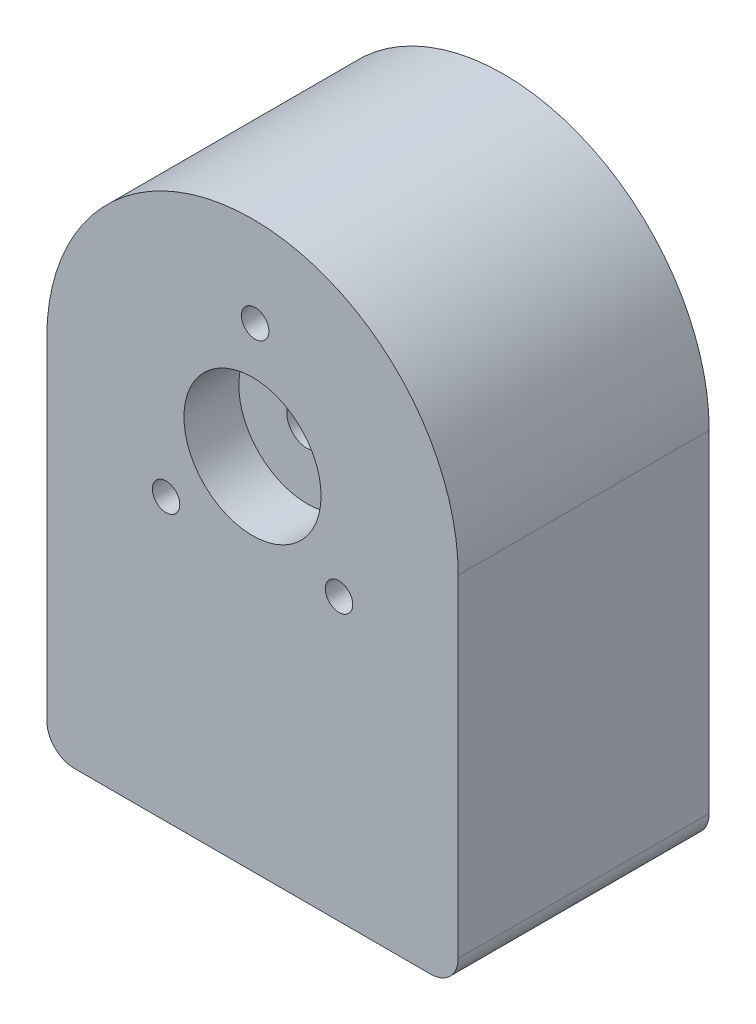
ISO-10303-21;
HEADER;
FILE_DESCRIPTION(('STEP AP214'),'2;1');
FILE_NAME('part.step','',(''),(''),'','','');
FILE_SCHEMA(('AUTOMOTIVE_DESIGN { 1 0 10303 214 1 1 1 1 }'));
ENDSEC;
DATA;
#1=APPLICATION_CONTEXT('core data for automotive mechanical design processes');
#2=APPLICATION_PROTOCOL_DEFINITION('international standard','automotive_design',2000,#1);
#3=PRODUCT_CONTEXT('',#1,'mechanical');
#4=PRODUCT('Part','Part','',(#3));
#5=PRODUCT_RELATED_PRODUCT_CATEGORY('part','',(#4));
#6=PRODUCT_DEFINITION_FORMATION('','',#4);
#7=PRODUCT_DEFINITION_CONTEXT('part definition',#1,'design');
#8=PRODUCT_DEFINITION('design','',#6,#7);
#9=PRODUCT_DEFINITION_SHAPE('','',#8);
#10=(LENGTH_UNIT() NAMED_UNIT(*) SI_UNIT(.MILLI.,.METRE.));
#11=(NAMED_UNIT(*) PLANE_ANGLE_UNIT() SI_UNIT($,.RADIAN.));
#12=(NAMED_UNIT(*) SI_UNIT($,.STERADIAN.) SOLID_ANGLE_UNIT());
#13=UNCERTAINTY_MEASURE_WITH_UNIT(LENGTH_MEASURE(1.E-05),#10,'distance_accuracy_value','');
#14=(GEOMETRIC_REPRESENTATION_CONTEXT(3) GLOBAL_UNCERTAINTY_ASSIGNED_CONTEXT((#13)) GLOBAL_UNIT_ASSIGNED_CONTEXT((#10,
#11,#12)) REPRESENTATION_CONTEXT('',''));
#15=CARTESIAN_POINT('',(0.,0.,0.));
#16=DIRECTION('',(0.,0.,1.));
#17=DIRECTION('',(1.,0.,0.));
#18=AXIS2_PLACEMENT_3D('',#15,#16,#17);
#19=CARTESIAN_POINT('',(-11.4705882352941,11.5529411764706,18.3));
#20=DIRECTION('',(0.,0.,-1.));
#21=DIRECTION('',(-1.,0.,0.));
#22=AXIS2_PLACEMENT_3D('',#19,#20,#21);
#23=CYLINDRICAL_SURFACE('',#22,15.);
#24=CARTESIAN_POINT('',(-11.4705882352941,11.5529411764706,0.));
#25=DIRECTION('',(0.,0.,1.));
#26=DIRECTION('',(1.,0.,0.));
#27=AXIS2_PLACEMENT_3D('',#24,#25,#26);
#28=CIRCLE('',#27,15.);
#29=CARTESIAN_POINT('',(3.52941176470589,11.5529411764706,0.));
#30=VERTEX_POINT('',#29);
#31=CARTESIAN_POINT('',(-26.4705882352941,11.5529411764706,0.));
#32=VERTEX_POINT('',#31);
#33=EDGE_CURVE('E106',#30,#32,#28,.T.);
#34=ORIENTED_EDGE('',*,*,#33,.T.);
#35=DIRECTION('',(0.,0.,-1.));
#36=VECTOR('',#35,1.);
#37=CARTESIAN_POINT('',(-26.4705882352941,11.5529411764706,18.3));
#38=LINE('',#37,#36);
#39=CARTESIAN_POINT('',(-26.4705882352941,11.5529411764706,18.3));
#40=VERTEX_POINT('',#39);
#41=EDGE_CURVE('E89',#40,#32,#38,.T.);
#42=ORIENTED_EDGE('',*,*,#41,.F.);
#43=CARTESIAN_POINT('',(-11.4705882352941,11.5529411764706,18.3));
#44=DIRECTION('',(0.,0.,1.));
#45=DIRECTION('',(1.,0.,0.));
#46=AXIS2_PLACEMENT_3D('',#43,#44,#45);
#47=CIRCLE('',#46,15.);
#48=CARTESIAN_POINT('',(3.52941176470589,11.5529411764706,18.3));
#49=VERTEX_POINT('',#48);
#50=EDGE_CURVE('E94',#49,#40,#47,.T.);
#51=ORIENTED_EDGE('',*,*,#50,.F.);
#52=DIRECTION('',(0.,0.,-1.));
#53=VECTOR('',#52,1.);
#54=CARTESIAN_POINT('',(3.52941176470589,11.5529411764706,18.3));
#55=LINE('',#54,#53);
#56=EDGE_CURVE('E108',#49,#30,#55,.T.);
#57=ORIENTED_EDGE('',*,*,#56,.T.);
#58=EDGE_LOOP('',(#34,#42,#51,#57));
#59=FACE_BOUND('',#58,.T.);
#60=ADVANCED_FACE('F33',(#59),#23,.T.);
#61=CARTESIAN_POINT('',(-26.4705882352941,11.5529411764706,18.3));
#62=DIRECTION('',(1.,0.,0.));
#63=DIRECTION('',(0.,1.,0.));
#64=AXIS2_PLACEMENT_3D('',#61,#62,#63);
#65=PLANE('',#64);
#66=DIRECTION('',(0.,-1.,0.));
#67=VECTOR('',#66,1.);
#68=CARTESIAN_POINT('',(-26.4705882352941,11.5529411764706,0.));
#69=LINE('',#68,#67);
#70=CARTESIAN_POINT('',(-26.4705882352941,-12.6470588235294,0.));
#71=VERTEX_POINT('',#70);
#72=EDGE_CURVE('E138',#32,#71,#69,.T.);
#73=ORIENTED_EDGE('',*,*,#72,.T.);
#74=DIRECTION('',(0.,0.,-1.));
#75=VECTOR('',#74,1.);
#76=CARTESIAN_POINT('',(-26.4705882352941,-12.6470588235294,18.3));
#77=LINE('',#76,#75);
#78=CARTESIAN_POINT('',(-26.4705882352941,-12.6470588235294,18.3));
#79=VERTEX_POINT('',#78);
#80=EDGE_CURVE('E11',#71,#79,#77,.F.);
#81=ORIENTED_EDGE('',*,*,#80,.T.);
#82=DIRECTION('',(0.,-1.,0.));
#83=VECTOR('',#82,1.);
#84=CARTESIAN_POINT('',(-26.4705882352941,11.5529411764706,18.3));
#85=LINE('',#84,#83);
#86=EDGE_CURVE('E85',#40,#79,#85,.T.);
#87=ORIENTED_EDGE('',*,*,#86,.F.);
#88=ORIENTED_EDGE('',*,*,#41,.T.);
#89=EDGE_LOOP('',(#73,#81,#87,#88));
#90=FACE_BOUND('',#89,.T.);
#91=ADVANCED_FACE('F87',(#90),#65,.F.);
#92=CARTESIAN_POINT('',(-26.4705882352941,-14.6470588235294,18.3));
#93=DIRECTION('',(0.,1.,0.));
#94=DIRECTION('',(0.,0.,1.));
#95=AXIS2_PLACEMENT_3D('',#92,#93,#94);
#96=PLANE('',#95);
#97=DIRECTION('',(1.,0.,0.));
#98=VECTOR('',#97,1.);
#99=CARTESIAN_POINT('',(-26.4705882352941,-14.6470588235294,0.));
#100=LINE('',#99,#98);
#101=CARTESIAN_POINT('',(-24.4705882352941,-14.6470588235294,0.));
#102=VERTEX_POINT('',#101);
#103=CARTESIAN_POINT('',(1.52941176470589,-14.6470588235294,0.));
#104=VERTEX_POINT('',#103);
#105=EDGE_CURVE('E135',#102,#104,#100,.T.);
#106=ORIENTED_EDGE('',*,*,#105,.T.);
#107=DIRECTION('',(0.,0.,-1.));
#108=VECTOR('',#107,1.);
#109=CARTESIAN_POINT('',(1.52941176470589,-14.6470588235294,18.3));
#110=LINE('',#109,#108);
#111=CARTESIAN_POINT('',(1.52941176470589,-14.6470588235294,18.3));
#112=VERTEX_POINT('',#111);
#113=EDGE_CURVE('E54',#104,#112,#110,.F.);
#114=ORIENTED_EDGE('',*,*,#113,.T.);
#115=DIRECTION('',(1.,0.,0.));
#116=VECTOR('',#115,1.);
#117=CARTESIAN_POINT('',(-26.4705882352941,-14.6470588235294,18.3));
#118=LINE('',#117,#116);
#119=CARTESIAN_POINT('',(-24.4705882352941,-14.6470588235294,18.3));
#120=VERTEX_POINT('',#119);
#121=EDGE_CURVE('E93',#120,#112,#118,.T.);
#122=ORIENTED_EDGE('',*,*,#121,.F.);
#123=DIRECTION('',(0.,0.,-1.));
#124=VECTOR('',#123,1.);
#125=CARTESIAN_POINT('',(-24.4705882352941,-14.6470588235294,18.3));
#126=LINE('',#125,#124);
#127=EDGE_CURVE('E119',#120,#102,#126,.T.);
#128=ORIENTED_EDGE('',*,*,#127,.T.);
#129=EDGE_LOOP('',(#106,#114,#122,#128));
#130=FACE_BOUND('',#129,.T.);
#131=ADVANCED_FACE('F136',(#130),#96,.F.);
#132=CARTESIAN_POINT('',(3.52941176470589,-14.6470588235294,18.3));
#133=DIRECTION('',(-1.,0.,0.));
#134=DIRECTION('',(0.,0.,1.));
#135=AXIS2_PLACEMENT_3D('',#132,#133,#134);
#136=PLANE('',#135);
#137=DIRECTION('',(0.,1.,0.));
#138=VECTOR('',#137,1.);
#139=CARTESIAN_POINT('',(3.52941176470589,-14.6470588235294,18.3));
#140=LINE('',#139,#138);
#141=CARTESIAN_POINT('',(3.52941176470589,-12.6470588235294,18.3));
#142=VERTEX_POINT('',#141);
#143=EDGE_CURVE('E99',#142,#49,#140,.T.);
#144=ORIENTED_EDGE('',*,*,#143,.F.);
#145=DIRECTION('',(0.,0.,-1.));
#146=VECTOR('',#145,1.);
#147=CARTESIAN_POINT('',(3.52941176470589,-12.6470588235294,18.3));
#148=LINE('',#147,#146);
#149=CARTESIAN_POINT('',(3.52941176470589,-12.6470588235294,0.));
#150=VERTEX_POINT('',#149);
#151=EDGE_CURVE('E107',#142,#150,#148,.T.);
#152=ORIENTED_EDGE('',*,*,#151,.T.);
#153=DIRECTION('',(0.,1.,0.));
#154=VECTOR('',#153,1.);
#155=CARTESIAN_POINT('',(3.52941176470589,-14.6470588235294,0.));
#156=LINE('',#155,#154);
#157=EDGE_CURVE('E103',#150,#30,#156,.T.);
#158=ORIENTED_EDGE('',*,*,#157,.T.);
#159=ORIENTED_EDGE('',*,*,#56,.F.);
#160=EDGE_LOOP('',(#144,#152,#158,#159));
#161=FACE_BOUND('',#160,.T.);
#162=ADVANCED_FACE('F128',(#161),#136,.F.);
#163=CARTESIAN_POINT('',(-11.4705882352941,11.5529411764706,18.3));
#164=DIRECTION('',(0.,0.,1.));
#165=DIRECTION('',(1.,0.,0.));
#166=AXIS2_PLACEMENT_3D('',#163,#164,#165);
#167=PLANE('',#166);
#168=CARTESIAN_POINT('',(-17.7761413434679,5.85294117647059,18.3));
#169=DIRECTION('',(0.,0.,1.));
#170=DIRECTION('',(1.,0.,0.));
#171=AXIS2_PLACEMENT_3D('',#168,#169,#170);
#172=CIRCLE('',#171,1.);
#173=CARTESIAN_POINT('',(-16.7761413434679,5.85294117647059,18.3));
#174=VERTEX_POINT('',#173);
#175=EDGE_CURVE('E169',#174,#174,#172,.T.);
#176=ORIENTED_EDGE('',*,*,#175,.F.);
#177=EDGE_LOOP('',(#176));
#178=FACE_BOUND('',#177,.T.);
#179=CARTESIAN_POINT('',(-5.16503512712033,5.85294117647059,18.3));
#180=DIRECTION('',(0.,0.,1.));
#181=DIRECTION('',(1.,0.,0.));
#182=AXIS2_PLACEMENT_3D('',#179,#180,#181);
#183=CIRCLE('',#182,1.);
#184=CARTESIAN_POINT('',(-4.16503512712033,5.85294117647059,18.3));
#185=VERTEX_POINT('',#184);
#186=EDGE_CURVE('E163',#185,#185,#183,.T.);
#187=ORIENTED_EDGE('',*,*,#186,.F.);
#188=EDGE_LOOP('',(#187));
#189=FACE_BOUND('',#188,.T.);
#190=CARTESIAN_POINT('',(-11.2788857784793,20.0529411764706,18.3));
#191=DIRECTION('',(0.,0.,1.));
#192=DIRECTION('',(1.,0.,0.));
#193=AXIS2_PLACEMENT_3D('',#190,#191,#192);
#194=CIRCLE('',#193,1.);
#195=CARTESIAN_POINT('',(-10.2788857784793,20.0529411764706,18.3));
#196=VERTEX_POINT('',#195);
#197=EDGE_CURVE('E157',#196,#196,#194,.T.);
#198=ORIENTED_EDGE('',*,*,#197,.F.);
#199=EDGE_LOOP('',(#198));
#200=FACE_BOUND('',#199,.T.);
#201=CARTESIAN_POINT('',(-11.4705882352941,11.5529411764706,18.3));
#202=DIRECTION('',(0.,0.,1.));
#203=DIRECTION('',(1.,0.,0.));
#204=AXIS2_PLACEMENT_3D('',#201,#202,#203);
#205=CIRCLE('',#204,5.);
#206=CARTESIAN_POINT('',(-6.47058823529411,11.5529411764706,18.3));
#207=VERTEX_POINT('',#206);
#208=EDGE_CURVE('E145',#207,#207,#205,.T.);
#209=ORIENTED_EDGE('',*,*,#208,.F.);
#210=EDGE_LOOP('',(#209));
#211=FACE_BOUND('',#210,.T.);
#212=ORIENTED_EDGE('',*,*,#121,.T.);
#213=CARTESIAN_POINT('',(1.52941176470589,-12.6470588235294,18.3));
#214=DIRECTION('',(0.,0.,1.));
#215=DIRECTION('',(1.,0.,0.));
#216=AXIS2_PLACEMENT_3D('',#213,#214,#215);
#217=CIRCLE('',#216,2.);
#218=EDGE_CURVE('E41',#112,#142,#217,.T.);
#219=ORIENTED_EDGE('',*,*,#218,.T.);
#220=ORIENTED_EDGE('',*,*,#143,.T.);
#221=ORIENTED_EDGE('',*,*,#50,.T.);
#222=ORIENTED_EDGE('',*,*,#86,.T.);
#223=CARTESIAN_POINT('',(-24.4705882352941,-12.6470588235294,18.3));
#224=DIRECTION('',(0.,0.,1.));
#225=DIRECTION('',(1.,0.,0.));
#226=AXIS2_PLACEMENT_3D('',#223,#224,#225);
#227=CIRCLE('',#226,2.);
#228=EDGE_CURVE('E123',#79,#120,#227,.T.);
#229=ORIENTED_EDGE('',*,*,#228,.T.);
#230=EDGE_LOOP('',(#212,#219,#220,#221,#222,#229));
#231=FACE_BOUND('',#230,.T.);
#232=ADVANCED_FACE('F97',(#178,#189,#200,#211,#231),#167,.T.);
#233=CARTESIAN_POINT('',(-11.4705882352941,11.5529411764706,0.));
#234=DIRECTION('',(0.,0.,1.));
#235=DIRECTION('',(1.,0.,0.));
#236=AXIS2_PLACEMENT_3D('',#233,#234,#235);
#237=PLANE('',#236);
#238=ORIENTED_EDGE('',*,*,#157,.F.);
#239=CARTESIAN_POINT('',(1.52941176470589,-12.6470588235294,0.));
#240=DIRECTION('',(0.,0.,1.));
#241=DIRECTION('',(1.,0.,0.));
#242=AXIS2_PLACEMENT_3D('',#239,#240,#241);
#243=CIRCLE('',#242,2.);
#244=EDGE_CURVE('E117',#150,#104,#243,.F.);
#245=ORIENTED_EDGE('',*,*,#244,.T.);
#246=ORIENTED_EDGE('',*,*,#105,.F.);
#247=CARTESIAN_POINT('',(-24.4705882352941,-12.6470588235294,0.));
#248=DIRECTION('',(0.,0.,1.));
#249=DIRECTION('',(1.,0.,0.));
#250=AXIS2_PLACEMENT_3D('',#247,#248,#249);
#251=CIRCLE('',#250,2.);
#252=EDGE_CURVE('E111',#102,#71,#251,.F.);
#253=ORIENTED_EDGE('',*,*,#252,.T.);
#254=ORIENTED_EDGE('',*,*,#72,.F.);
#255=ORIENTED_EDGE('',*,*,#33,.F.);
#256=EDGE_LOOP('',(#238,#245,#246,#253,#254,#255));
#257=FACE_BOUND('',#256,.T.);
#258=ADVANCED_FACE('F134',(#257),#237,.F.);
#259=CARTESIAN_POINT('',(-11.4705882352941,11.5529411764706,14.3));
#260=DIRECTION('',(0.,0.,1.));
#261=DIRECTION('',(1.,0.,0.));
#262=AXIS2_PLACEMENT_3D('',#259,#260,#261);
#263=CYLINDRICAL_SURFACE('',#262,5.);
#264=CARTESIAN_POINT('',(-11.4705882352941,11.5529411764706,14.3));
#265=DIRECTION('',(0.,0.,1.));
#266=DIRECTION('',(1.,0.,0.));
#267=AXIS2_PLACEMENT_3D('',#264,#265,#266);
#268=CIRCLE('',#267,5.);
#269=CARTESIAN_POINT('',(-6.47058823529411,11.5529411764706,14.3));
#270=VERTEX_POINT('',#269);
#271=EDGE_CURVE('E142',#270,#270,#268,.T.);
#272=ORIENTED_EDGE('',*,*,#271,.F.);
#273=EDGE_LOOP('',(#272));
#274=FACE_BOUND('',#273,.T.);
#275=ORIENTED_EDGE('',*,*,#208,.T.);
#276=EDGE_LOOP('',(#275));
#277=FACE_BOUND('',#276,.T.);
#278=ADVANCED_FACE('F193',(#274,#277),#263,.F.);
#279=CARTESIAN_POINT('',(-11.4705882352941,11.5529411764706,14.3));
#280=DIRECTION('',(0.,0.,1.));
#281=DIRECTION('',(1.,0.,0.));
#282=AXIS2_PLACEMENT_3D('',#279,#280,#281);
#283=PLANE('',#282);
#284=CARTESIAN_POINT('',(-11.4705882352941,11.5529411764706,14.3));
#285=DIRECTION('',(0.,0.,1.));
#286=DIRECTION('',(1.,0.,0.));
#287=AXIS2_PLACEMENT_3D('',#284,#285,#286);
#288=CIRCLE('',#287,1.5);
#289=CARTESIAN_POINT('',(-9.97058823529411,11.5529411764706,14.3));
#290=VERTEX_POINT('',#289);
#291=EDGE_CURVE('E151',#290,#290,#288,.T.);
#292=ORIENTED_EDGE('',*,*,#291,.F.);
#293=EDGE_LOOP('',(#292));
#294=FACE_BOUND('',#293,.T.);
#295=ORIENTED_EDGE('',*,*,#271,.T.);
#296=EDGE_LOOP('',(#295));
#297=FACE_BOUND('',#296,.T.);
#298=ADVANCED_FACE('F195',(#294,#297),#283,.T.);
#299=CARTESIAN_POINT('',(-11.4705882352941,11.5529411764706,5.3));
#300=DIRECTION('',(0.,0.,1.));
#301=DIRECTION('',(1.,0.,0.));
#302=AXIS2_PLACEMENT_3D('',#299,#300,#301);
#303=CYLINDRICAL_SURFACE('',#302,1.5);
#304=CARTESIAN_POINT('',(-11.4705882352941,11.5529411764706,5.3));
#305=DIRECTION('',(0.,0.,1.));
#306=DIRECTION('',(1.,0.,0.));
#307=AXIS2_PLACEMENT_3D('',#304,#305,#306);
#308=CIRCLE('',#307,1.5);
#309=CARTESIAN_POINT('',(-9.97058823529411,11.5529411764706,5.3));
#310=VERTEX_POINT('',#309);
#311=EDGE_CURVE('E148',#310,#310,#308,.T.);
#312=ORIENTED_EDGE('',*,*,#311,.F.);
#313=EDGE_LOOP('',(#312));
#314=FACE_BOUND('',#313,.T.);
#315=ORIENTED_EDGE('',*,*,#291,.T.);
#316=EDGE_LOOP('',(#315));
#317=FACE_BOUND('',#316,.T.);
#318=ADVANCED_FACE('F202',(#314,#317),#303,.F.);
#319=CARTESIAN_POINT('',(-11.4705882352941,11.5529411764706,5.3));
#320=DIRECTION('',(0.,0.,1.));
#321=DIRECTION('',(1.,0.,0.));
#322=AXIS2_PLACEMENT_3D('',#319,#320,#321);
#323=PLANE('',#322);
#324=ORIENTED_EDGE('',*,*,#311,.T.);
#325=EDGE_LOOP('',(#324));
#326=FACE_BOUND('',#325,.T.);
#327=ADVANCED_FACE('F238',(#326),#323,.T.);
#328=CARTESIAN_POINT('',(-11.2788857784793,20.0529411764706,9.6));
#329=DIRECTION('',(0.,0.,1.));
#330=DIRECTION('',(1.,0.,0.));
#331=AXIS2_PLACEMENT_3D('',#328,#329,#330);
#332=CYLINDRICAL_SURFACE('',#331,1.);
#333=CARTESIAN_POINT('',(-11.2788857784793,20.0529411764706,9.6));
#334=DIRECTION('',(0.,0.,1.));
#335=DIRECTION('',(1.,0.,0.));
#336=AXIS2_PLACEMENT_3D('',#333,#334,#335);
#337=CIRCLE('',#336,1.);
#338=CARTESIAN_POINT('',(-10.2788857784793,20.0529411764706,9.6));
#339=VERTEX_POINT('',#338);
#340=EDGE_CURVE('E154',#339,#339,#337,.T.);
#341=ORIENTED_EDGE('',*,*,#340,.F.);
#342=EDGE_LOOP('',(#341));
#343=FACE_BOUND('',#342,.T.);
#344=ORIENTED_EDGE('',*,*,#197,.T.);
#345=EDGE_LOOP('',(#344));
#346=FACE_BOUND('',#345,.T.);
#347=ADVANCED_FACE('F234',(#343,#346),#332,.F.);
#348=CARTESIAN_POINT('',(-11.2788857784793,20.0529411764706,9.6));
#349=DIRECTION('',(0.,0.,1.));
#350=DIRECTION('',(1.,0.,0.));
#351=AXIS2_PLACEMENT_3D('',#348,#349,#350);
#352=PLANE('',#351);
#353=ORIENTED_EDGE('',*,*,#340,.T.);
#354=EDGE_LOOP('',(#353));
#355=FACE_BOUND('',#354,.T.);
#356=ADVANCED_FACE('F230',(#355),#352,.T.);
#357=CARTESIAN_POINT('',(-5.16503512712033,5.85294117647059,9.6));
#358=DIRECTION('',(0.,0.,1.));
#359=DIRECTION('',(1.,0.,0.));
#360=AXIS2_PLACEMENT_3D('',#357,#358,#359);
#361=CYLINDRICAL_SURFACE('',#360,1.);
#362=CARTESIAN_POINT('',(-5.16503512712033,5.85294117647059,9.6));
#363=DIRECTION('',(0.,0.,1.));
#364=DIRECTION('',(1.,0.,0.));
#365=AXIS2_PLACEMENT_3D('',#362,#363,#364);
#366=CIRCLE('',#365,1.);
#367=CARTESIAN_POINT('',(-4.16503512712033,5.85294117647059,9.6));
#368=VERTEX_POINT('',#367);
#369=EDGE_CURVE('E160',#368,#368,#366,.T.);
#370=ORIENTED_EDGE('',*,*,#369,.F.);
#371=EDGE_LOOP('',(#370));
#372=FACE_BOUND('',#371,.T.);
#373=ORIENTED_EDGE('',*,*,#186,.T.);
#374=EDGE_LOOP('',(#373));
#375=FACE_BOUND('',#374,.T.);
#376=ADVANCED_FACE('F226',(#372,#375),#361,.F.);
#377=CARTESIAN_POINT('',(-5.16503512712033,5.85294117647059,9.6));
#378=DIRECTION('',(0.,0.,1.));
#379=DIRECTION('',(1.,0.,0.));
#380=AXIS2_PLACEMENT_3D('',#377,#378,#379);
#381=PLANE('',#380);
#382=ORIENTED_EDGE('',*,*,#369,.T.);
#383=EDGE_LOOP('',(#382));
#384=FACE_BOUND('',#383,.T.);
#385=ADVANCED_FACE('F180',(#384),#381,.T.);
#386=CARTESIAN_POINT('',(-17.7761413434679,5.85294117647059,9.6));
#387=DIRECTION('',(0.,0.,1.));
#388=DIRECTION('',(1.,0.,0.));
#389=AXIS2_PLACEMENT_3D('',#386,#387,#388);
#390=CYLINDRICAL_SURFACE('',#389,1.);
#391=CARTESIAN_POINT('',(-17.7761413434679,5.85294117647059,9.6));
#392=DIRECTION('',(0.,0.,1.));
#393=DIRECTION('',(1.,0.,0.));
#394=AXIS2_PLACEMENT_3D('',#391,#392,#393);
#395=CIRCLE('',#394,1.);
#396=CARTESIAN_POINT('',(-16.7761413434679,5.85294117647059,9.6));
#397=VERTEX_POINT('',#396);
#398=EDGE_CURVE('E166',#397,#397,#395,.T.);
#399=ORIENTED_EDGE('',*,*,#398,.F.);
#400=EDGE_LOOP('',(#399));
#401=FACE_BOUND('',#400,.T.);
#402=ORIENTED_EDGE('',*,*,#175,.T.);
#403=EDGE_LOOP('',(#402));
#404=FACE_BOUND('',#403,.T.);
#405=ADVANCED_FACE('F177',(#401,#404),#390,.F.);
#406=CARTESIAN_POINT('',(-17.7761413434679,5.85294117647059,9.6));
#407=DIRECTION('',(0.,0.,1.));
#408=DIRECTION('',(1.,0.,0.));
#409=AXIS2_PLACEMENT_3D('',#406,#407,#408);
#410=PLANE('',#409);
#411=ORIENTED_EDGE('',*,*,#398,.T.);
#412=EDGE_LOOP('',(#411));
#413=FACE_BOUND('',#412,.T.);
#414=ADVANCED_FACE('F175',(#413),#410,.T.);
#415=CARTESIAN_POINT('',(1.52941176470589,-12.6470588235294,18.3));
#416=DIRECTION('',(0.,0.,-1.));
#417=DIRECTION('',(-1.,0.,0.));
#418=AXIS2_PLACEMENT_3D('',#415,#416,#417);
#419=CYLINDRICAL_SURFACE('',#418,2.);
#420=ORIENTED_EDGE('',*,*,#218,.F.);
#421=ORIENTED_EDGE('',*,*,#113,.F.);
#422=ORIENTED_EDGE('',*,*,#244,.F.);
#423=ORIENTED_EDGE('',*,*,#151,.F.);
#424=EDGE_LOOP('',(#420,#421,#422,#423));
#425=FACE_BOUND('',#424,.T.);
#426=ADVANCED_FACE('F131',(#425),#419,.T.);
#427=CARTESIAN_POINT('',(-24.4705882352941,-12.6470588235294,18.3));
#428=DIRECTION('',(0.,0.,-1.));
#429=DIRECTION('',(-1.,0.,0.));
#430=AXIS2_PLACEMENT_3D('',#427,#428,#429);
#431=CYLINDRICAL_SURFACE('',#430,2.);
#432=ORIENTED_EDGE('',*,*,#228,.F.);
#433=ORIENTED_EDGE('',*,*,#80,.F.);
#434=ORIENTED_EDGE('',*,*,#252,.F.);
#435=ORIENTED_EDGE('',*,*,#127,.F.);
#436=EDGE_LOOP('',(#432,#433,#434,#435));
#437=FACE_BOUND('',#436,.T.);
#438=ADVANCED_FACE('F35',(#437),#431,.T.);
#439=CLOSED_SHELL('',(#60,#91,#131,#162,#232,#258,#278,#298,#318,#327,#347,#356,#376,#385,#405,
#414,#426,#438));
#440=MANIFOLD_SOLID_BREP('B2',#439);
#441=ADVANCED_BREP_SHAPE_REPRESENTATION('',(#18,#440),#14);
#442=SHAPE_DEFINITION_REPRESENTATION(#9,#441);
ENDSEC;
END-ISO-10303-21;
